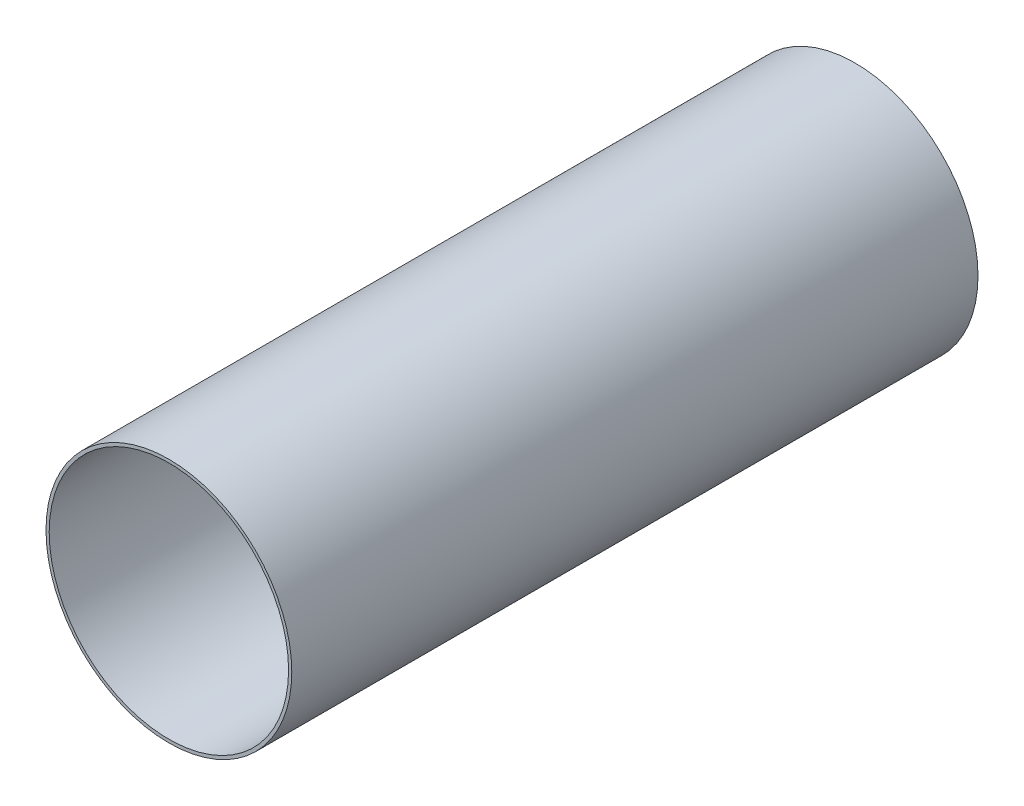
ISO-10303-21;
HEADER;
FILE_DESCRIPTION(('STEP AP214'),'2;1');
FILE_NAME('part.step','',(''),(''),'','','');
FILE_SCHEMA(('AUTOMOTIVE_DESIGN { 1 0 10303 214 1 1 1 1 }'));
ENDSEC;
DATA;
#1=APPLICATION_CONTEXT('core data for automotive mechanical design processes');
#2=APPLICATION_PROTOCOL_DEFINITION('international standard','automotive_design',2000,#1);
#3=PRODUCT_CONTEXT('',#1,'mechanical');
#4=PRODUCT('Part','Part','',(#3));
#5=PRODUCT_RELATED_PRODUCT_CATEGORY('part','',(#4));
#6=PRODUCT_DEFINITION_FORMATION('','',#4);
#7=PRODUCT_DEFINITION_CONTEXT('part definition',#1,'design');
#8=PRODUCT_DEFINITION('design','',#6,#7);
#9=PRODUCT_DEFINITION_SHAPE('','',#8);
#10=(LENGTH_UNIT() NAMED_UNIT(*) SI_UNIT(.MILLI.,.METRE.));
#11=(NAMED_UNIT(*) PLANE_ANGLE_UNIT() SI_UNIT($,.RADIAN.));
#12=(NAMED_UNIT(*) SI_UNIT($,.STERADIAN.) SOLID_ANGLE_UNIT());
#13=UNCERTAINTY_MEASURE_WITH_UNIT(LENGTH_MEASURE(1.E-05),#10,'distance_accuracy_value','');
#14=(GEOMETRIC_REPRESENTATION_CONTEXT(3) GLOBAL_UNCERTAINTY_ASSIGNED_CONTEXT((#13)) GLOBAL_UNIT_ASSIGNED_CONTEXT((#10,
#11,#12)) REPRESENTATION_CONTEXT('',''));
#15=CARTESIAN_POINT('',(0.,0.,0.));
#16=DIRECTION('',(0.,0.,1.));
#17=DIRECTION('',(1.,0.,0.));
#18=AXIS2_PLACEMENT_3D('',#15,#16,#17);
#19=CARTESIAN_POINT('',(0.,0.,215.));
#20=DIRECTION('',(0.,0.,1.));
#21=DIRECTION('',(1.,0.,0.));
#22=AXIS2_PLACEMENT_3D('',#19,#20,#21);
#23=PLANE('',#22);
#24=CARTESIAN_POINT('',(0.,0.,215.));
#25=DIRECTION('',(0.,0.,1.));
#26=DIRECTION('',(1.,0.,0.));
#27=AXIS2_PLACEMENT_3D('',#24,#25,#26);
#28=CIRCLE('',#27,75.);
#29=CARTESIAN_POINT('',(75.,0.,215.));
#30=VERTEX_POINT('',#29);
#31=EDGE_CURVE('E27',#30,#30,#28,.T.);
#32=ORIENTED_EDGE('',*,*,#31,.F.);
#33=EDGE_LOOP('',(#32));
#34=FACE_BOUND('',#33,.T.);
#35=CARTESIAN_POINT('',(0.,0.,215.));
#36=DIRECTION('',(0.,0.,-1.));
#37=DIRECTION('',(-1.,0.,0.));
#38=AXIS2_PLACEMENT_3D('',#35,#36,#37);
#39=CIRCLE('',#38,77.);
#40=CARTESIAN_POINT('',(-77.,0.,215.));
#41=VERTEX_POINT('',#40);
#42=EDGE_CURVE('E9',#41,#41,#39,.T.);
#43=ORIENTED_EDGE('',*,*,#42,.F.);
#44=EDGE_LOOP('',(#43));
#45=FACE_BOUND('',#44,.T.);
#46=ADVANCED_FACE('F14',(#34,#45),#23,.T.);
#47=CARTESIAN_POINT('',(0.,0.,-215.));
#48=DIRECTION('',(0.,0.,-1.));
#49=DIRECTION('',(-1.,0.,0.));
#50=AXIS2_PLACEMENT_3D('',#47,#48,#49);
#51=PLANE('',#50);
#52=CARTESIAN_POINT('',(0.,0.,-215.));
#53=DIRECTION('',(0.,0.,-1.));
#54=DIRECTION('',(-1.,0.,0.));
#55=AXIS2_PLACEMENT_3D('',#52,#53,#54);
#56=CIRCLE('',#55,75.);
#57=CARTESIAN_POINT('',(-75.,0.,-215.));
#58=VERTEX_POINT('',#57);
#59=EDGE_CURVE('E18',#58,#58,#56,.T.);
#60=ORIENTED_EDGE('',*,*,#59,.F.);
#61=EDGE_LOOP('',(#60));
#62=FACE_BOUND('',#61,.T.);
#63=CARTESIAN_POINT('',(0.,0.,-215.));
#64=DIRECTION('',(0.,0.,1.));
#65=DIRECTION('',(1.,0.,0.));
#66=AXIS2_PLACEMENT_3D('',#63,#64,#65);
#67=CIRCLE('',#66,77.);
#68=CARTESIAN_POINT('',(77.,0.,-215.));
#69=VERTEX_POINT('',#68);
#70=EDGE_CURVE('E22',#69,#69,#67,.T.);
#71=ORIENTED_EDGE('',*,*,#70,.F.);
#72=EDGE_LOOP('',(#71));
#73=FACE_BOUND('',#72,.T.);
#74=ADVANCED_FACE('F40',(#62,#73),#51,.T.);
#75=CARTESIAN_POINT('',(0.,0.,-215.));
#76=DIRECTION('',(0.,0.,1.));
#77=DIRECTION('',(1.,0.,0.));
#78=AXIS2_PLACEMENT_3D('',#75,#76,#77);
#79=CYLINDRICAL_SURFACE('',#78,77.);
#80=ORIENTED_EDGE('',*,*,#42,.T.);
#81=EDGE_LOOP('',(#80));
#82=FACE_BOUND('',#81,.T.);
#83=ORIENTED_EDGE('',*,*,#70,.T.);
#84=EDGE_LOOP('',(#83));
#85=FACE_BOUND('',#84,.T.);
#86=ADVANCED_FACE('F16',(#82,#85),#79,.T.);
#87=CARTESIAN_POINT('',(0.,0.,-216.));
#88=DIRECTION('',(0.,0.,1.));
#89=DIRECTION('',(1.,0.,0.));
#90=AXIS2_PLACEMENT_3D('',#87,#88,#89);
#91=CYLINDRICAL_SURFACE('',#90,75.);
#92=ORIENTED_EDGE('',*,*,#31,.T.);
#93=EDGE_LOOP('',(#92));
#94=FACE_BOUND('',#93,.T.);
#95=ORIENTED_EDGE('',*,*,#59,.T.);
#96=EDGE_LOOP('',(#95));
#97=FACE_BOUND('',#96,.T.);
#98=ADVANCED_FACE('F34',(#94,#97),#91,.F.);
#99=CLOSED_SHELL('',(#46,#74,#86,#98));
#100=MANIFOLD_SOLID_BREP('B1',#99);
#101=ADVANCED_BREP_SHAPE_REPRESENTATION('',(#18,#100),#14);
#102=SHAPE_DEFINITION_REPRESENTATION(#9,#101);
ENDSEC;
END-ISO-10303-21;
